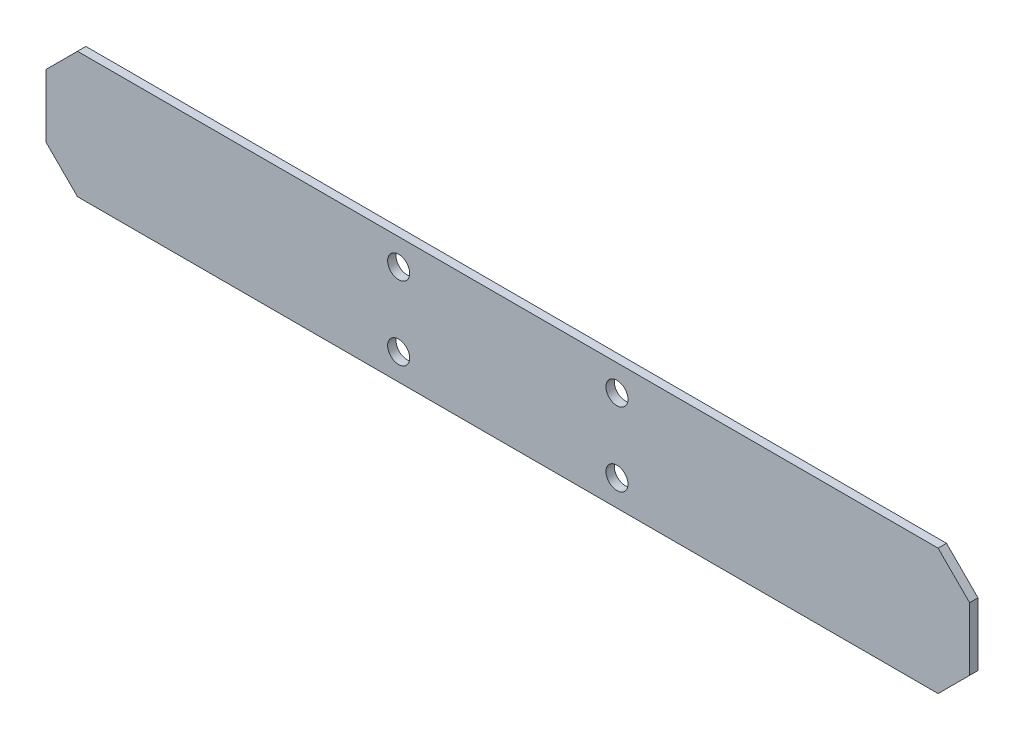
from build123d import *

# Parameters (mm, degrees)
SKETCH_1_W      = 880
SKETCH_1_H      = 120
SKETCH_1_R      = 10.5
EXTRUDE_1_DEPTH = 8
CHAMFER_1_SIZE  = 30


with BuildPart() as part:
    # Sketch 1 → Extrude 1 (new body)
    with BuildSketch(Plane.XY):
        Rectangle(SKETCH_1_W, SKETCH_1_H)
        with Locations((-104, 35)):
            Circle(SKETCH_1_R, mode=Mode.SUBTRACT)
        with Locations(Location((-104, -35, 0), (0, 0, 180))):
            Circle(SKETCH_1_R, mode=Mode.SUBTRACT)
        with Locations((104, -35)):
            Circle(SKETCH_1_R, mode=Mode.SUBTRACT)
        with Locations(Location((104, 35, 0), (0, 0, 180))):
            Circle(SKETCH_1_R, mode=Mode.SUBTRACT)
    extrude(amount=EXTRUDE_1_DEPTH)

    # Chamfer 1
    chamfer_1_edges = [part.edges().sort_by_distance(p)[0] for p in [
        (-440, 60, 4),
        (440, 60, 4),
        (440, -60, 4),
        (-440, -60, 4),
    ]]
    chamfer(chamfer_1_edges, length=CHAMFER_1_SIZE)


solid = part.part
